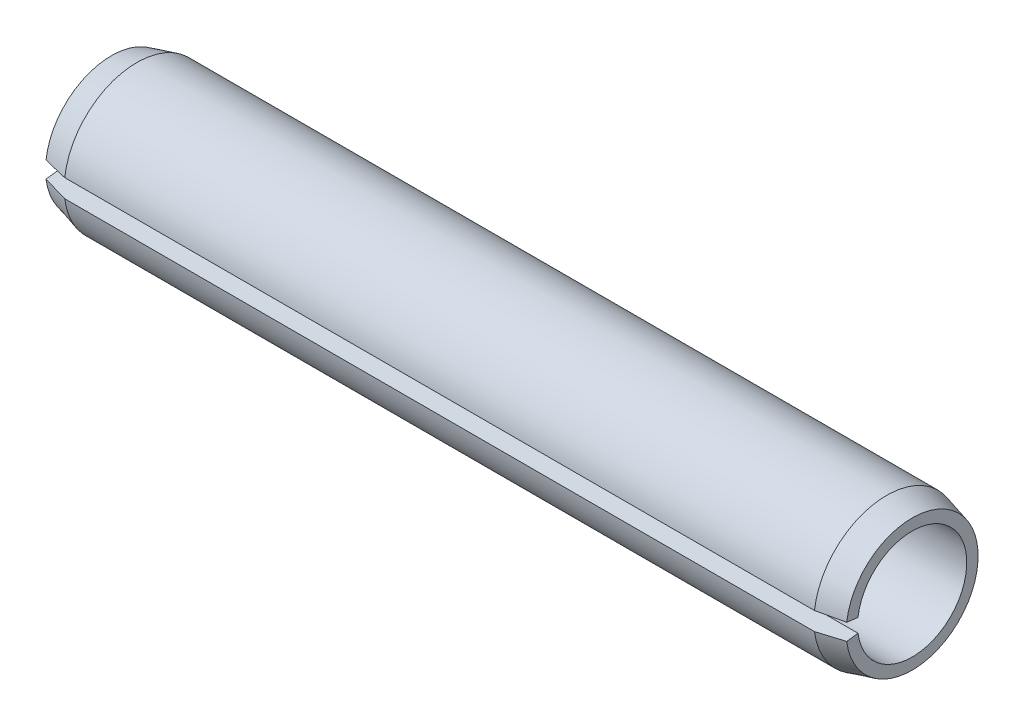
ISO-10303-21;
HEADER;
FILE_DESCRIPTION(('STEP AP214'),'2;1');
FILE_NAME('part.step','',(''),(''),'','','');
FILE_SCHEMA(('AUTOMOTIVE_DESIGN { 1 0 10303 214 1 1 1 1 }'));
ENDSEC;
DATA;
#1=APPLICATION_CONTEXT('core data for automotive mechanical design processes');
#2=APPLICATION_PROTOCOL_DEFINITION('international standard','automotive_design',2000,#1);
#3=PRODUCT_CONTEXT('',#1,'mechanical');
#4=PRODUCT('Part','Part','',(#3));
#5=PRODUCT_RELATED_PRODUCT_CATEGORY('part','',(#4));
#6=PRODUCT_DEFINITION_FORMATION('','',#4);
#7=PRODUCT_DEFINITION_CONTEXT('part definition',#1,'design');
#8=PRODUCT_DEFINITION('design','',#6,#7);
#9=PRODUCT_DEFINITION_SHAPE('','',#8);
#10=(LENGTH_UNIT() NAMED_UNIT(*) SI_UNIT(.MILLI.,.METRE.));
#11=(NAMED_UNIT(*) PLANE_ANGLE_UNIT() SI_UNIT($,.RADIAN.));
#12=(NAMED_UNIT(*) SI_UNIT($,.STERADIAN.) SOLID_ANGLE_UNIT());
#13=UNCERTAINTY_MEASURE_WITH_UNIT(LENGTH_MEASURE(1.E-05),#10,'distance_accuracy_value','');
#14=(GEOMETRIC_REPRESENTATION_CONTEXT(3) GLOBAL_UNCERTAINTY_ASSIGNED_CONTEXT((#13)) GLOBAL_UNIT_ASSIGNED_CONTEXT((#10,
#11,#12)) REPRESENTATION_CONTEXT('',''));
#15=CARTESIAN_POINT('',(0.,0.,0.));
#16=DIRECTION('',(0.,0.,1.));
#17=DIRECTION('',(1.,0.,0.));
#18=AXIS2_PLACEMENT_3D('',#15,#16,#17);
#19=CARTESIAN_POINT('',(0.,1.65621778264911,0.));
#20=DIRECTION('',(-1.,0.,0.));
#21=DIRECTION('',(0.,-1.,0.));
#22=AXIS2_PLACEMENT_3D('',#19,#20,#21);
#23=PLANE('',#22);
#24=DIRECTION('',(0.,0.125333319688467,0.992114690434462));
#25=VECTOR('',#24,1.);
#26=CARTESIAN_POINT('',(0.,0.187999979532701,1.48817203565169));
#27=LINE('',#26,#25);
#28=CARTESIAN_POINT('',(0.,0.187999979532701,1.48817203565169));
#29=VERTEX_POINT('',#28);
#30=CARTESIAN_POINT('',(0.,0.227158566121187,1.79814394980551));
#31=VERTEX_POINT('',#30);
#32=EDGE_CURVE('E67',#29,#31,#27,.T.);
#33=ORIENTED_EDGE('',*,*,#32,.T.);
#34=CARTESIAN_POINT('',(0.,0.,0.));
#35=DIRECTION('',(1.,0.,0.));
#36=DIRECTION('',(0.,1.,0.));
#37=AXIS2_PLACEMENT_3D('',#34,#35,#36);
#38=CIRCLE('',#37,1.81243556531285);
#39=CARTESIAN_POINT('',(0.,-0.227158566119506,1.79814394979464));
#40=VERTEX_POINT('',#39);
#41=EDGE_CURVE('E90',#40,#31,#38,.T.);
#42=ORIENTED_EDGE('',*,*,#41,.F.);
#43=DIRECTION('',(0.,0.125333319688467,-0.992114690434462));
#44=VECTOR('',#43,1.);
#45=CARTESIAN_POINT('',(0.,-0.250666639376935,1.98422938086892));
#46=LINE('',#45,#44);
#47=CARTESIAN_POINT('',(0.,-0.187999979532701,1.48817203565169));
#48=VERTEX_POINT('',#47);
#49=EDGE_CURVE('E79',#40,#48,#46,.T.);
#50=ORIENTED_EDGE('',*,*,#49,.T.);
#51=CARTESIAN_POINT('',(0.,0.,0.));
#52=DIRECTION('',(1.,0.,0.));
#53=DIRECTION('',(0.,1.,0.));
#54=AXIS2_PLACEMENT_3D('',#51,#52,#53);
#55=CIRCLE('',#54,1.5);
#56=EDGE_CURVE('E21',#29,#48,#55,.F.);
#57=ORIENTED_EDGE('',*,*,#56,.F.);
#58=EDGE_LOOP('',(#33,#42,#50,#57));
#59=FACE_BOUND('',#58,.T.);
#60=ADVANCED_FACE('F17',(#59),#23,.T.);
#61=CARTESIAN_POINT('',(0.,0.,0.));
#62=DIRECTION('',(1.,0.,0.));
#63=DIRECTION('',(0.,1.,0.));
#64=AXIS2_PLACEMENT_3D('',#61,#62,#63);
#65=CYLINDRICAL_SURFACE('',#64,1.5);
#66=DIRECTION('',(1.,0.,0.));
#67=VECTOR('',#66,1.);
#68=CARTESIAN_POINT('',(11.,0.187999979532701,1.48817203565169));
#69=LINE('',#68,#67);
#70=CARTESIAN_POINT('',(22.,0.187999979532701,1.48817203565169));
#71=VERTEX_POINT('',#70);
#72=EDGE_CURVE('E71',#71,#29,#69,.F.);
#73=ORIENTED_EDGE('',*,*,#72,.T.);
#74=ORIENTED_EDGE('',*,*,#56,.T.);
#75=DIRECTION('',(1.,0.,0.));
#76=VECTOR('',#75,1.);
#77=CARTESIAN_POINT('',(11.,-0.187999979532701,1.48817203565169));
#78=LINE('',#77,#76);
#79=CARTESIAN_POINT('',(22.,-0.187999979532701,1.48817203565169));
#80=VERTEX_POINT('',#79);
#81=EDGE_CURVE('E101',#48,#80,#78,.T.);
#82=ORIENTED_EDGE('',*,*,#81,.T.);
#83=CARTESIAN_POINT('',(22.,0.,0.));
#84=DIRECTION('',(1.,0.,0.));
#85=DIRECTION('',(0.,1.,0.));
#86=AXIS2_PLACEMENT_3D('',#83,#84,#85);
#87=CIRCLE('',#86,1.5);
#88=EDGE_CURVE('E82',#71,#80,#87,.F.);
#89=ORIENTED_EDGE('',*,*,#88,.F.);
#90=EDGE_LOOP('',(#73,#74,#82,#89));
#91=FACE_BOUND('',#90,.T.);
#92=ADVANCED_FACE('F83',(#91),#65,.F.);
#93=CARTESIAN_POINT('',(22.,1.65621778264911,0.));
#94=DIRECTION('',(1.,0.,0.));
#95=DIRECTION('',(0.,0.,-1.));
#96=AXIS2_PLACEMENT_3D('',#93,#94,#95);
#97=PLANE('',#96);
#98=DIRECTION('',(0.,0.125333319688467,0.992114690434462));
#99=VECTOR('',#98,1.);
#100=CARTESIAN_POINT('',(22.,0.187999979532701,1.48817203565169));
#101=LINE('',#100,#99);
#102=CARTESIAN_POINT('',(22.0000000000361,0.227158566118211,1.79814394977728));
#103=VERTEX_POINT('',#102);
#104=EDGE_CURVE('E86',#103,#71,#101,.F.);
#105=ORIENTED_EDGE('',*,*,#104,.T.);
#106=ORIENTED_EDGE('',*,*,#88,.T.);
#107=DIRECTION('',(0.,0.125333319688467,-0.992114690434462));
#108=VECTOR('',#107,1.);
#109=CARTESIAN_POINT('',(22.,-0.250666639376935,1.98422938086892));
#110=LINE('',#109,#108);
#111=CARTESIAN_POINT('',(22.0000000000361,-0.22715856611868,1.79814394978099));
#112=VERTEX_POINT('',#111);
#113=EDGE_CURVE('E98',#80,#112,#110,.F.);
#114=ORIENTED_EDGE('',*,*,#113,.T.);
#115=CARTESIAN_POINT('',(22.0000000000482,0.,0.));
#116=DIRECTION('',(-1.,0.,0.));
#117=DIRECTION('',(0.,0.,1.));
#118=AXIS2_PLACEMENT_3D('',#115,#116,#117);
#119=CIRCLE('',#118,1.81243556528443);
#120=EDGE_CURVE('E106',#103,#112,#119,.T.);
#121=ORIENTED_EDGE('',*,*,#120,.F.);
#122=EDGE_LOOP('',(#105,#106,#114,#121));
#123=FACE_BOUND('',#122,.T.);
#124=ADVANCED_FACE('F111',(#123),#97,.T.);
#125=CARTESIAN_POINT('',(11.,-0.250666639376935,1.98422938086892));
#126=DIRECTION('',(0.,-0.992114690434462,-0.125333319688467));
#127=DIRECTION('',(0.,0.125333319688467,-0.992114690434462));
#128=AXIS2_PLACEMENT_3D('',#125,#126,#127);
#129=PLANE('',#128);
#130=ORIENTED_EDGE('',*,*,#113,.F.);
#131=ORIENTED_EDGE('',*,*,#81,.F.);
#132=ORIENTED_EDGE('',*,*,#49,.F.);
#133=DIRECTION('',(-0.965925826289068,0.032438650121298,-0.256778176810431));
#134=VECTOR('',#133,1.);
#135=CARTESIAN_POINT('',(499000.,-16758.1250943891,132654.126864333));
#136=LINE('',#135,#134);
#137=CARTESIAN_POINT('',(0.700000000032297,-0.250666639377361,1.98422938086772));
#138=VERTEX_POINT('',#137);
#139=EDGE_CURVE('E96',#138,#40,#136,.T.);
#140=ORIENTED_EDGE('',*,*,#139,.F.);
#141=DIRECTION('',(1.,0.,0.));
#142=VECTOR('',#141,1.);
#143=CARTESIAN_POINT('',(11.,-0.250666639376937,1.98422938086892));
#144=LINE('',#143,#142);
#145=CARTESIAN_POINT('',(21.2999999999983,-0.250666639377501,1.9842293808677));
#146=VERTEX_POINT('',#145);
#147=EDGE_CURVE('E94',#146,#138,#144,.F.);
#148=ORIENTED_EDGE('',*,*,#147,.F.);
#149=DIRECTION('',(0.965925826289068,0.032438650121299,-0.25677817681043));
#150=VECTOR('',#149,1.);
#151=CARTESIAN_POINT('',(-499000.,-16758.8639195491,132659.975263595));
#152=LINE('',#151,#150);
#153=EDGE_CURVE('E88',#112,#146,#152,.F.);
#154=ORIENTED_EDGE('',*,*,#153,.F.);
#155=EDGE_LOOP('',(#130,#131,#132,#140,#148,#154));
#156=FACE_BOUND('',#155,.T.);
#157=ADVANCED_FACE('F115',(#156),#129,.F.);
#158=CARTESIAN_POINT('',(0.70000000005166,0.,0.));
#159=DIRECTION('',(1.,0.,0.));
#160=DIRECTION('',(0.,1.,0.));
#161=AXIS2_PLACEMENT_3D('',#158,#159,#160);
#162=CONICAL_SURFACE('',#161,2.00000000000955,0.261799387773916);
#163=DIRECTION('',(0.965925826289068,0.0324386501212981,0.25677817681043));
#164=VECTOR('',#163,1.);
#165=CARTESIAN_POINT('',(0.,0.22715856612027,1.79814394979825));
#166=LINE('',#165,#164);
#167=CARTESIAN_POINT('',(0.700000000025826,0.250666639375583,1.98422938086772));
#168=VERTEX_POINT('',#167);
#169=EDGE_CURVE('E72',#31,#168,#166,.T.);
#170=ORIENTED_EDGE('',*,*,#169,.T.);
#171=CARTESIAN_POINT('',(0.699999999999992,0.,0.));
#172=DIRECTION('',(1.,0.,0.));
#173=DIRECTION('',(0.,1.,0.));
#174=AXIS2_PLACEMENT_3D('',#171,#172,#173);
#175=CIRCLE('',#174,2.);
#176=EDGE_CURVE('E102',#138,#168,#175,.T.);
#177=ORIENTED_EDGE('',*,*,#176,.F.);
#178=ORIENTED_EDGE('',*,*,#139,.T.);
#179=ORIENTED_EDGE('',*,*,#41,.T.);
#180=EDGE_LOOP('',(#170,#177,#178,#179));
#181=FACE_BOUND('',#180,.T.);
#182=ADVANCED_FACE('F127',(#181),#162,.T.);
#183=CARTESIAN_POINT('',(11.,0.187999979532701,1.48817203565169));
#184=DIRECTION('',(0.,0.992114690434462,-0.125333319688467));
#185=DIRECTION('',(0.,0.125333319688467,0.992114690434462));
#186=AXIS2_PLACEMENT_3D('',#183,#184,#185);
#187=PLANE('',#186);
#188=DIRECTION('',(1.,0.,0.));
#189=VECTOR('',#188,1.);
#190=CARTESIAN_POINT('',(11.,0.250666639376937,1.98422938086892));
#191=LINE('',#190,#189);
#192=CARTESIAN_POINT('',(21.2999999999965,0.250666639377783,1.98422938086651));
#193=VERTEX_POINT('',#192);
#194=EDGE_CURVE('E27',#168,#193,#191,.T.);
#195=ORIENTED_EDGE('',*,*,#194,.F.);
#196=ORIENTED_EDGE('',*,*,#169,.F.);
#197=ORIENTED_EDGE('',*,*,#32,.F.);
#198=ORIENTED_EDGE('',*,*,#72,.F.);
#199=ORIENTED_EDGE('',*,*,#104,.F.);
#200=DIRECTION('',(0.965925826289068,-0.0324386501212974,-0.25677817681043));
#201=VECTOR('',#200,1.);
#202=CARTESIAN_POINT('',(-499000.,16758.8639195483,132659.975263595));
#203=LINE('',#202,#201);
#204=EDGE_CURVE('E36',#193,#103,#203,.T.);
#205=ORIENTED_EDGE('',*,*,#204,.F.);
#206=EDGE_LOOP('',(#195,#196,#197,#198,#199,#205));
#207=FACE_BOUND('',#206,.T.);
#208=ADVANCED_FACE('F69',(#207),#187,.F.);
#209=CARTESIAN_POINT('',(21.2999999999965,0.,0.));
#210=DIRECTION('',(-1.,0.,0.));
#211=DIRECTION('',(0.,0.,1.));
#212=AXIS2_PLACEMENT_3D('',#209,#210,#211);
#213=CONICAL_SURFACE('',#212,2.00000000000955,0.261799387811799);
#214=ORIENTED_EDGE('',*,*,#204,.T.);
#215=ORIENTED_EDGE('',*,*,#120,.T.);
#216=ORIENTED_EDGE('',*,*,#153,.T.);
#217=CARTESIAN_POINT('',(21.3,0.,0.));
#218=DIRECTION('',(1.,0.,0.));
#219=DIRECTION('',(0.,1.,0.));
#220=AXIS2_PLACEMENT_3D('',#217,#218,#219);
#221=CIRCLE('',#220,2.);
#222=EDGE_CURVE('E11',#193,#146,#221,.F.);
#223=ORIENTED_EDGE('',*,*,#222,.F.);
#224=EDGE_LOOP('',(#214,#215,#216,#223));
#225=FACE_BOUND('',#224,.T.);
#226=ADVANCED_FACE('F122',(#225),#213,.T.);
#227=CARTESIAN_POINT('',(11.,0.,0.));
#228=DIRECTION('',(1.,0.,0.));
#229=DIRECTION('',(0.,1.,0.));
#230=AXIS2_PLACEMENT_3D('',#227,#228,#229);
#231=CYLINDRICAL_SURFACE('',#230,2.);
#232=ORIENTED_EDGE('',*,*,#194,.T.);
#233=ORIENTED_EDGE('',*,*,#222,.T.);
#234=ORIENTED_EDGE('',*,*,#147,.T.);
#235=ORIENTED_EDGE('',*,*,#176,.T.);
#236=EDGE_LOOP('',(#232,#233,#234,#235));
#237=FACE_BOUND('',#236,.T.);
#238=ADVANCED_FACE('F19',(#237),#231,.T.);
#239=CLOSED_SHELL('',(#60,#92,#124,#157,#182,#208,#226,#238));
#240=MANIFOLD_SOLID_BREP('B1',#239);
#241=ADVANCED_BREP_SHAPE_REPRESENTATION('',(#18,#240),#14);
#242=SHAPE_DEFINITION_REPRESENTATION(#9,#241);
ENDSEC;
END-ISO-10303-21;
